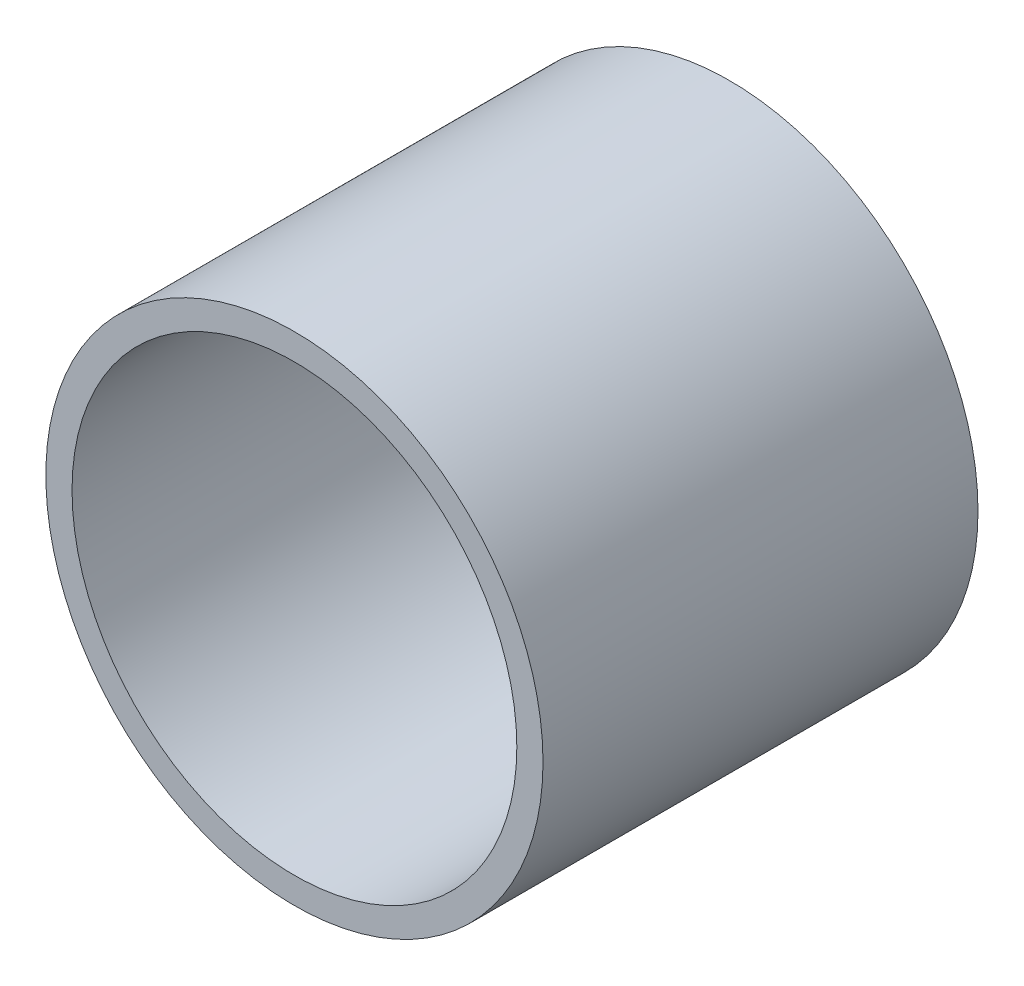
from build123d import *

# Parameters (mm, degrees)
PIPESKETCH_R    = 57.15
PIPESKETCH_R_2  = 51.1302
EXTRUSION_DEPTH = 100


with BuildPart() as part:
    # PipeSketch → Extrusion (new body)
    with BuildSketch(Plane.XY):
        Circle(PIPESKETCH_R)
        Circle(PIPESKETCH_R_2, mode=Mode.SUBTRACT)
    extrude(amount=EXTRUSION_DEPTH)


solid = part.part
